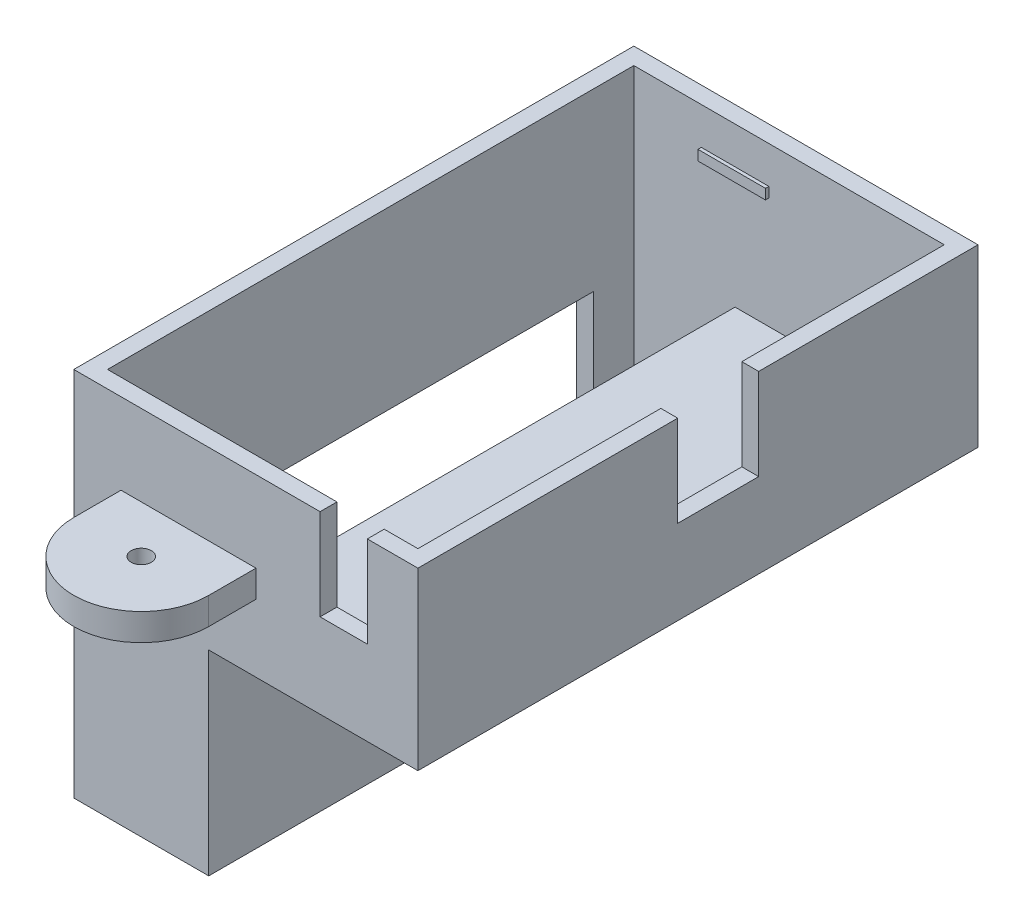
from build123d import *

# Parameters (mm, degrees)
SKETCH1_W           = 51
SKETCH1_H           = 83
BOSS_EXTRUDE1_DEPTH = 55
SKETCH2_W           = 15
SKETCH2_H           = 78
CUT_EXTRUDE1_DEPTH  = 52.5
SKETCH3_W           = 31
SKETCH3_H           = 78
CUT_EXTRUDE2_DEPTH  = 23.5
SKETCH4_W           = 57
SKETCH4_H           = 19
CUT_EXTRUDE3_DEPTH  = 2.5
SKETCH5_W           = 12
SKETCH5_H           = 13.5
CUT_EXTRUDE4_DEPTH  = 2.5
SKETCH6_W           = 7
SKETCH6_H           = 13.5
CUT_EXTRUDE5_DEPTH  = 2.5
SKETCH7_W           = 10
SKETCH7_H           = 1.5
BOSS_EXTRUDE2_DEPTH = 0.5
SKETCH8_W           = 10
SKETCH8_H           = 1.5
BOSS_EXTRUDE3_DEPTH = 0.5
SKETCH10_W          = 31
SKETCH10_H          = 83
CUT_EXTRUDE6_DEPTH  = 29
SKETCH11_R          = 1.5
BOSS_EXTRUDE4_DEPTH = 16
SKETCH12_W          = 17
SKETCH12_H          = 12
CUT_EXTRUDE7_DEPTH  = 20


with BuildPart() as part:
    # Sketch1 → Boss-Extrude1 (new body)
    with BuildSketch(Plane(origin=(0, 0, 0), x_dir=(1, 0, 0), z_dir=(0, 1, 0))):
        Rectangle(SKETCH1_W, SKETCH1_H)
    extrude(amount=BOSS_EXTRUDE1_DEPTH)

    # Sketch2 → Cut-Extrude1 (cut)
    with BuildSketch(Plane(origin=(0, 55, 0), x_dir=(1, 0, 0), z_dir=(0, 1, 0))):
        with Locations((-15.5, 0)):
            Rectangle(SKETCH2_W, SKETCH2_H)
    extrude(amount=-CUT_EXTRUDE1_DEPTH, mode=Mode.SUBTRACT)

    # Sketch3 → Cut-Extrude2 (cut)
    with BuildSketch(Plane(origin=(0, 55, 0), x_dir=(1, 0, 0), z_dir=(0, 1, 0))):
        with Locations((7.5, 0)):
            Rectangle(SKETCH3_W, SKETCH3_H)
    extrude(amount=-CUT_EXTRUDE2_DEPTH, mode=Mode.SUBTRACT)

    # Sketch4 → Cut-Extrude3 (cut)
    with BuildSketch(Plane.ZY.offset(25.5)):
        with Locations((-4.5, 19.5)):
            Rectangle(SKETCH4_W, SKETCH4_H)
    extrude(amount=-CUT_EXTRUDE3_DEPTH, mode=Mode.SUBTRACT)

    # Sketch5 → Cut-Extrude4 (cut)
    with BuildSketch(Plane(origin=(25.5, 0, 0), x_dir=(0, 0, -1), z_dir=(1, 0, 0))):
        with Locations((3, 48.25)):
            Rectangle(SKETCH5_W, SKETCH5_H)
    extrude(amount=-CUT_EXTRUDE4_DEPTH, mode=Mode.SUBTRACT)

    # Sketch6 → Cut-Extrude5 (cut)
    with BuildSketch(Plane.XY.offset(41.5)):
        with Locations((14.5, 48.25)):
            Rectangle(SKETCH6_W, SKETCH6_H)
    extrude(amount=-CUT_EXTRUDE5_DEPTH, mode=Mode.SUBTRACT)

    # Sketch7 → Boss-Extrude2 (add)
    with BuildSketch(Plane.XY.offset(-39)):
        with Locations((-7.996258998, 48.75)):
            Rectangle(SKETCH7_W, SKETCH7_H)
    extrude(amount=BOSS_EXTRUDE2_DEPTH)

    # Sketch8 → Boss-Extrude3 (add)
    with BuildSketch(Plane(origin=(0, 0, 39), x_dir=(-1, 0, 0), z_dir=(0, 0, -1))):
        with Locations((7.996258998, 48.75)):
            Rectangle(SKETCH8_W, SKETCH8_H)
    extrude(amount=BOSS_EXTRUDE3_DEPTH)

    # Sketch10 → Cut-Extrude6 (cut)
    with BuildSketch(Plane.XZ):
        with Locations((10, 0)):
            Rectangle(SKETCH10_W, SKETCH10_H)
    extrude(amount=-CUT_EXTRUDE6_DEPTH, mode=Mode.SUBTRACT)

    # Sketch11 → Boss-Extrude4 (add)
    with BuildSketch(Plane(origin=(0, 55, 0), x_dir=(1, 0, 0), z_dir=(0, 1, 0))):
        with BuildLine():
            Line((-18.5, -41.5), (1.5, -41.5))
            Line((1.5, -41.5), (1.5, -48.5))
            ThreePointArc((1.5, -48.5), (-8.5, -58.5), (-18.5, -48.5))
            Line((-18.5, -48.5), (-18.5, -41.5))
        make_face()
        with Locations(Location((-8.5, -48.5, 0), (0, 0, 270))):
            Circle(SKETCH11_R, mode=Mode.SUBTRACT)
    extrude(amount=-BOSS_EXTRUDE4_DEPTH)

    # Sketch12 → Cut-Extrude7 (cut)
    with BuildSketch(Plane(origin=(1.5, 0, 0), x_dir=(0, 0, -1), z_dir=(1, 0, 0))):
        with Locations((-50, 49)):
            Rectangle(SKETCH12_W, SKETCH12_H)
    extrude(amount=-CUT_EXTRUDE7_DEPTH, mode=Mode.SUBTRACT)


solid = part.part
